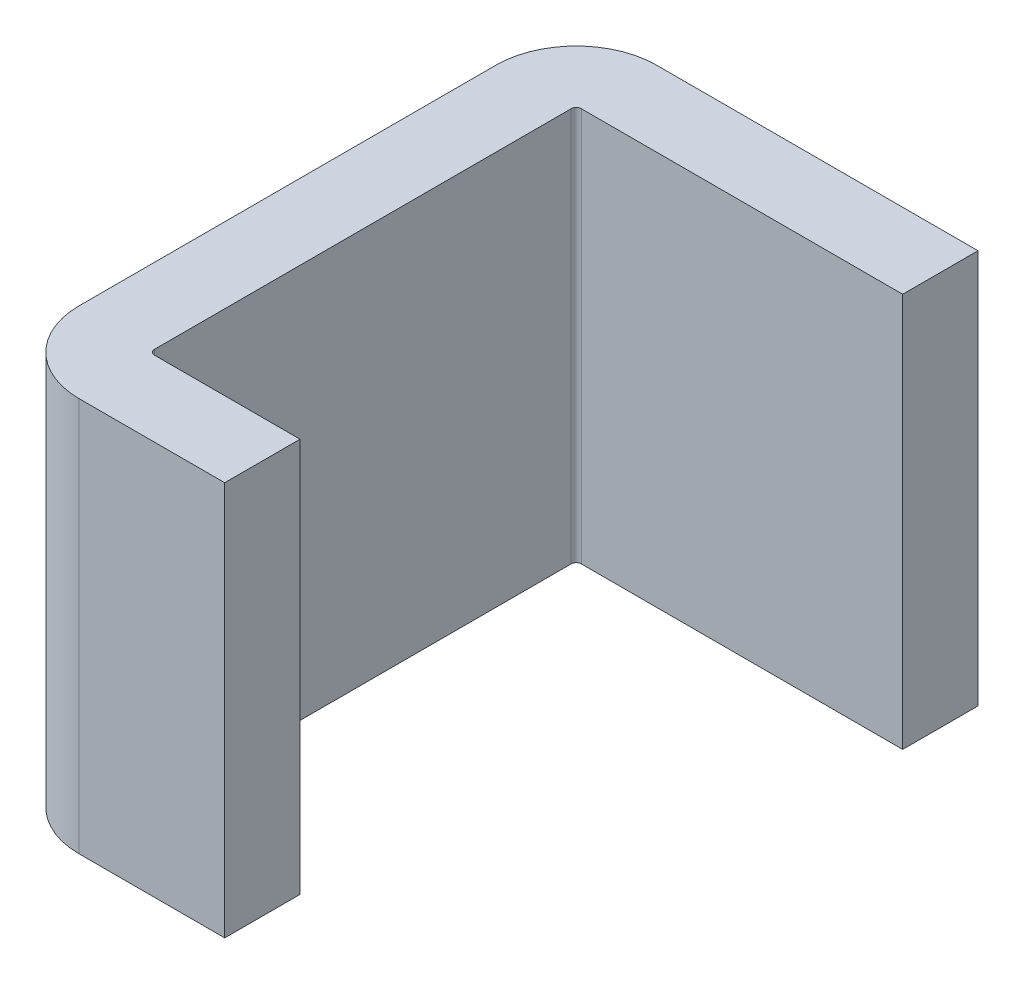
ISO-10303-21;
HEADER;
FILE_DESCRIPTION(('STEP AP214'),'2;1');
FILE_NAME('part.step','',(''),(''),'','','');
FILE_SCHEMA(('AUTOMOTIVE_DESIGN { 1 0 10303 214 1 1 1 1 }'));
ENDSEC;
DATA;
#1=APPLICATION_CONTEXT('core data for automotive mechanical design processes');
#2=APPLICATION_PROTOCOL_DEFINITION('international standard','automotive_design',2000,#1);
#3=PRODUCT_CONTEXT('',#1,'mechanical');
#4=PRODUCT('Part','Part','',(#3));
#5=PRODUCT_RELATED_PRODUCT_CATEGORY('part','',(#4));
#6=PRODUCT_DEFINITION_FORMATION('','',#4);
#7=PRODUCT_DEFINITION_CONTEXT('part definition',#1,'design');
#8=PRODUCT_DEFINITION('design','',#6,#7);
#9=PRODUCT_DEFINITION_SHAPE('','',#8);
#10=(LENGTH_UNIT() NAMED_UNIT(*) SI_UNIT(.MILLI.,.METRE.));
#11=(NAMED_UNIT(*) PLANE_ANGLE_UNIT() SI_UNIT($,.RADIAN.));
#12=(NAMED_UNIT(*) SI_UNIT($,.STERADIAN.) SOLID_ANGLE_UNIT());
#13=UNCERTAINTY_MEASURE_WITH_UNIT(LENGTH_MEASURE(1.E-05),#10,'distance_accuracy_value','');
#14=(GEOMETRIC_REPRESENTATION_CONTEXT(3) GLOBAL_UNCERTAINTY_ASSIGNED_CONTEXT((#13)) GLOBAL_UNIT_ASSIGNED_CONTEXT((#10,
#11,#12)) REPRESENTATION_CONTEXT('',''));
#15=CARTESIAN_POINT('',(0.,0.,0.));
#16=DIRECTION('',(0.,0.,1.));
#17=DIRECTION('',(1.,0.,0.));
#18=AXIS2_PLACEMENT_3D('',#15,#16,#17);
#19=CARTESIAN_POINT('',(-1.6,1.1,0.01));
#20=DIRECTION('',(1.,0.,0.));
#21=DIRECTION('',(0.,0.,1.));
#22=AXIS2_PLACEMENT_3D('',#19,#20,#21);
#23=PLANE('',#22);
#24=DIRECTION('',(0.,0.,1.));
#25=VECTOR('',#24,1.);
#26=CARTESIAN_POINT('',(-1.6,0.315,0.01));
#27=LINE('',#26,#25);
#28=CARTESIAN_POINT('',(-1.6,0.315,0.01));
#29=VERTEX_POINT('',#28);
#30=CARTESIAN_POINT('',(-1.6,0.315,0.84));
#31=VERTEX_POINT('',#30);
#32=EDGE_CURVE('E245',#29,#31,#27,.T.);
#33=ORIENTED_EDGE('',*,*,#32,.F.);
#34=DIRECTION('',(0.,-1.,0.));
#35=VECTOR('',#34,1.);
#36=CARTESIAN_POINT('',(-1.6,1.1,0.01));
#37=LINE('',#36,#35);
#38=CARTESIAN_POINT('',(-1.6,1.1,0.01));
#39=VERTEX_POINT('',#38);
#40=EDGE_CURVE('E192',#39,#29,#37,.T.);
#41=ORIENTED_EDGE('',*,*,#40,.F.);
#42=DIRECTION('',(0.,0.,1.));
#43=VECTOR('',#42,1.);
#44=CARTESIAN_POINT('',(-1.6,1.1,0.01));
#45=LINE('',#44,#43);
#46=CARTESIAN_POINT('',(-1.6,1.1,0.84));
#47=VERTEX_POINT('',#46);
#48=EDGE_CURVE('E201',#39,#47,#45,.T.);
#49=ORIENTED_EDGE('',*,*,#48,.T.);
#50=DIRECTION('',(0.,-1.,0.));
#51=VECTOR('',#50,1.);
#52=CARTESIAN_POINT('',(-1.6,1.1,0.84));
#53=LINE('',#52,#51);
#54=EDGE_CURVE('E11',#47,#31,#53,.T.);
#55=ORIENTED_EDGE('',*,*,#54,.T.);
#56=EDGE_LOOP('',(#33,#41,#49,#55));
#57=FACE_BOUND('',#56,.T.);
#58=ADVANCED_FACE('F17',(#57),#23,.T.);
#59=CARTESIAN_POINT('',(-1.59,0.,0.84));
#60=DIRECTION('',(0.,-1.,0.));
#61=DIRECTION('',(0.,0.,1.));
#62=AXIS2_PLACEMENT_3D('',#59,#60,#61);
#63=CYLINDRICAL_SURFACE('',#62,0.01);
#64=CARTESIAN_POINT('',(-1.59,0.315,0.84));
#65=DIRECTION('',(0.,1.,0.));
#66=DIRECTION('',(-1.,0.,0.));
#67=AXIS2_PLACEMENT_3D('',#64,#65,#66);
#68=CIRCLE('',#67,0.01);
#69=CARTESIAN_POINT('',(-1.59,0.315,0.85));
#70=VERTEX_POINT('',#69);
#71=EDGE_CURVE('E249',#31,#70,#68,.T.);
#72=ORIENTED_EDGE('',*,*,#71,.F.);
#73=ORIENTED_EDGE('',*,*,#54,.F.);
#74=CARTESIAN_POINT('',(-1.59,1.1,0.84));
#75=DIRECTION('',(0.,1.,0.));
#76=DIRECTION('',(-1.,0.,0.));
#77=AXIS2_PLACEMENT_3D('',#74,#75,#76);
#78=CIRCLE('',#77,0.01);
#79=CARTESIAN_POINT('',(-1.59,1.1,0.85));
#80=VERTEX_POINT('',#79);
#81=EDGE_CURVE('E187',#47,#80,#78,.T.);
#82=ORIENTED_EDGE('',*,*,#81,.T.);
#83=DIRECTION('',(0.,-1.,0.));
#84=VECTOR('',#83,1.);
#85=CARTESIAN_POINT('',(-1.59,1.1,0.85));
#86=LINE('',#85,#84);
#87=EDGE_CURVE('E220',#80,#70,#86,.T.);
#88=ORIENTED_EDGE('',*,*,#87,.T.);
#89=EDGE_LOOP('',(#72,#73,#82,#88));
#90=FACE_BOUND('',#89,.T.);
#91=ADVANCED_FACE('F383',(#90),#63,.F.);
#92=CARTESIAN_POINT('',(-1.3,0.,0.925));
#93=DIRECTION('',(-1.,0.,0.));
#94=DIRECTION('',(0.,0.,1.));
#95=AXIS2_PLACEMENT_3D('',#92,#93,#94);
#96=PLANE('',#95);
#97=DIRECTION('',(0.,1.,0.));
#98=VECTOR('',#97,1.);
#99=CARTESIAN_POINT('',(-1.3,-1.1,1.));
#100=LINE('',#99,#98);
#101=CARTESIAN_POINT('',(-1.3,0.315,1.));
#102=VERTEX_POINT('',#101);
#103=CARTESIAN_POINT('',(-1.3,1.1,1.));
#104=VERTEX_POINT('',#103);
#105=EDGE_CURVE('E37',#102,#104,#100,.T.);
#106=ORIENTED_EDGE('',*,*,#105,.F.);
#107=DIRECTION('',(0.,0.,-1.));
#108=VECTOR('',#107,1.);
#109=CARTESIAN_POINT('',(-1.3,0.315,0.925));
#110=LINE('',#109,#108);
#111=CARTESIAN_POINT('',(-1.3,0.315,0.85));
#112=VERTEX_POINT('',#111);
#113=EDGE_CURVE('E257',#102,#112,#110,.T.);
#114=ORIENTED_EDGE('',*,*,#113,.T.);
#115=DIRECTION('',(0.,-1.,0.));
#116=VECTOR('',#115,1.);
#117=CARTESIAN_POINT('',(-1.3,1.1,0.85));
#118=LINE('',#117,#116);
#119=CARTESIAN_POINT('',(-1.3,1.1,0.85));
#120=VERTEX_POINT('',#119);
#121=EDGE_CURVE('E25',#120,#112,#118,.T.);
#122=ORIENTED_EDGE('',*,*,#121,.F.);
#123=DIRECTION('',(0.,0.,-1.));
#124=VECTOR('',#123,1.);
#125=CARTESIAN_POINT('',(-1.3,1.1,1.));
#126=LINE('',#125,#124);
#127=EDGE_CURVE('E174',#104,#120,#126,.T.);
#128=ORIENTED_EDGE('',*,*,#127,.F.);
#129=EDGE_LOOP('',(#106,#114,#122,#128));
#130=FACE_BOUND('',#129,.T.);
#131=ADVANCED_FACE('F347',(#130),#96,.F.);
#132=CARTESIAN_POINT('',(-1.59,1.1,0.85));
#133=DIRECTION('',(0.,0.,-1.));
#134=DIRECTION('',(-1.,0.,0.));
#135=AXIS2_PLACEMENT_3D('',#132,#133,#134);
#136=PLANE('',#135);
#137=DIRECTION('',(1.,0.,0.));
#138=VECTOR('',#137,1.);
#139=CARTESIAN_POINT('',(-1.59,0.315,0.85));
#140=LINE('',#139,#138);
#141=EDGE_CURVE('E253',#70,#112,#140,.T.);
#142=ORIENTED_EDGE('',*,*,#141,.F.);
#143=ORIENTED_EDGE('',*,*,#87,.F.);
#144=DIRECTION('',(1.,0.,0.));
#145=VECTOR('',#144,1.);
#146=CARTESIAN_POINT('',(-1.59,1.1,0.85));
#147=LINE('',#146,#145);
#148=EDGE_CURVE('E184',#80,#120,#147,.T.);
#149=ORIENTED_EDGE('',*,*,#148,.T.);
#150=ORIENTED_EDGE('',*,*,#121,.T.);
#151=EDGE_LOOP('',(#142,#143,#149,#150));
#152=FACE_BOUND('',#151,.T.);
#153=ADVANCED_FACE('F342',(#152),#136,.T.);
#154=CARTESIAN_POINT('',(-1.59,-1.1,1.));
#155=DIRECTION('',(0.,0.,1.));
#156=DIRECTION('',(1.,0.,0.));
#157=AXIS2_PLACEMENT_3D('',#154,#155,#156);
#158=PLANE('',#157);
#159=DIRECTION('',(-1.,0.,0.));
#160=VECTOR('',#159,1.);
#161=CARTESIAN_POINT('',(-1.59,0.315,1.));
#162=LINE('',#161,#160);
#163=CARTESIAN_POINT('',(-1.59,0.315,1.));
#164=VERTEX_POINT('',#163);
#165=EDGE_CURVE('E228',#102,#164,#162,.T.);
#166=ORIENTED_EDGE('',*,*,#165,.F.);
#167=ORIENTED_EDGE('',*,*,#105,.T.);
#168=DIRECTION('',(1.,0.,0.));
#169=VECTOR('',#168,1.);
#170=CARTESIAN_POINT('',(-1.59,1.1,1.));
#171=LINE('',#170,#169);
#172=CARTESIAN_POINT('',(-1.59,1.1,1.));
#173=VERTEX_POINT('',#172);
#174=EDGE_CURVE('E191',#173,#104,#171,.T.);
#175=ORIENTED_EDGE('',*,*,#174,.F.);
#176=DIRECTION('',(0.,1.,0.));
#177=VECTOR('',#176,1.);
#178=CARTESIAN_POINT('',(-1.59,-1.1,1.));
#179=LINE('',#178,#177);
#180=EDGE_CURVE('E217',#164,#173,#179,.T.);
#181=ORIENTED_EDGE('',*,*,#180,.F.);
#182=EDGE_LOOP('',(#166,#167,#175,#181));
#183=FACE_BOUND('',#182,.T.);
#184=ADVANCED_FACE('F346',(#183),#158,.T.);
#185=CARTESIAN_POINT('',(-1.59,0.,0.01));
#186=DIRECTION('',(0.,-1.,0.));
#187=DIRECTION('',(0.,0.,1.));
#188=AXIS2_PLACEMENT_3D('',#185,#186,#187);
#189=CYLINDRICAL_SURFACE('',#188,0.01);
#190=CARTESIAN_POINT('',(-1.59,0.315,0.01));
#191=DIRECTION('',(0.,1.,0.));
#192=DIRECTION('',(-1.,0.,0.));
#193=AXIS2_PLACEMENT_3D('',#190,#191,#192);
#194=CIRCLE('',#193,0.01);
#195=CARTESIAN_POINT('',(-1.59,0.315,0.));
#196=VERTEX_POINT('',#195);
#197=EDGE_CURVE('E241',#196,#29,#194,.T.);
#198=ORIENTED_EDGE('',*,*,#197,.F.);
#199=DIRECTION('',(0.,-1.,0.));
#200=VECTOR('',#199,1.);
#201=CARTESIAN_POINT('',(-1.59,1.1,0.));
#202=LINE('',#201,#200);
#203=CARTESIAN_POINT('',(-1.59,1.1,0.));
#204=VERTEX_POINT('',#203);
#205=EDGE_CURVE('E195',#204,#196,#202,.T.);
#206=ORIENTED_EDGE('',*,*,#205,.F.);
#207=CARTESIAN_POINT('',(-1.59,1.1,0.01));
#208=DIRECTION('',(0.,1.,0.));
#209=DIRECTION('',(0.,0.,-1.));
#210=AXIS2_PLACEMENT_3D('',#207,#208,#209);
#211=CIRCLE('',#210,0.01);
#212=EDGE_CURVE('E179',#204,#39,#211,.T.);
#213=ORIENTED_EDGE('',*,*,#212,.T.);
#214=ORIENTED_EDGE('',*,*,#40,.T.);
#215=EDGE_LOOP('',(#198,#206,#213,#214));
#216=FACE_BOUND('',#215,.T.);
#217=ADVANCED_FACE('F356',(#216),#189,.F.);
#218=CARTESIAN_POINT('',(-0.95,0.,-0.075));
#219=DIRECTION('',(1.,0.,0.));
#220=DIRECTION('',(0.,1.,0.));
#221=AXIS2_PLACEMENT_3D('',#218,#219,#220);
#222=PLANE('',#221);
#223=DIRECTION('',(0.,0.,1.));
#224=VECTOR('',#223,1.);
#225=CARTESIAN_POINT('',(-0.95,0.315,-1.608456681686));
#226=LINE('',#225,#224);
#227=CARTESIAN_POINT('',(-0.95,0.315,-0.15));
#228=VERTEX_POINT('',#227);
#229=CARTESIAN_POINT('',(-0.95,0.315,0.));
#230=VERTEX_POINT('',#229);
#231=EDGE_CURVE('E141',#228,#230,#226,.T.);
#232=ORIENTED_EDGE('',*,*,#231,.F.);
#233=DIRECTION('',(0.,1.,0.));
#234=VECTOR('',#233,1.);
#235=CARTESIAN_POINT('',(-0.95,-1.1,-0.15));
#236=LINE('',#235,#234);
#237=CARTESIAN_POINT('',(-0.95,1.1,-0.15));
#238=VERTEX_POINT('',#237);
#239=EDGE_CURVE('E135',#228,#238,#236,.T.);
#240=ORIENTED_EDGE('',*,*,#239,.T.);
#241=DIRECTION('',(0.,0.,1.));
#242=VECTOR('',#241,1.);
#243=CARTESIAN_POINT('',(-0.95,1.1,-0.15));
#244=LINE('',#243,#242);
#245=CARTESIAN_POINT('',(-0.95,1.1,0.));
#246=VERTEX_POINT('',#245);
#247=EDGE_CURVE('E138',#238,#246,#244,.T.);
#248=ORIENTED_EDGE('',*,*,#247,.T.);
#249=DIRECTION('',(0.,-1.,0.));
#250=VECTOR('',#249,1.);
#251=CARTESIAN_POINT('',(-0.95,1.1,0.));
#252=LINE('',#251,#250);
#253=EDGE_CURVE('E225',#246,#230,#252,.T.);
#254=ORIENTED_EDGE('',*,*,#253,.T.);
#255=EDGE_LOOP('',(#232,#240,#248,#254));
#256=FACE_BOUND('',#255,.T.);
#257=ADVANCED_FACE('F137',(#256),#222,.T.);
#258=CARTESIAN_POINT('',(-0.95,1.1,0.));
#259=DIRECTION('',(0.,0.,1.));
#260=DIRECTION('',(0.,-1.,0.));
#261=AXIS2_PLACEMENT_3D('',#258,#259,#260);
#262=PLANE('',#261);
#263=DIRECTION('',(-1.,0.,0.));
#264=VECTOR('',#263,1.);
#265=CARTESIAN_POINT('',(-0.95,0.315,0.));
#266=LINE('',#265,#264);
#267=EDGE_CURVE('E175',#230,#196,#266,.T.);
#268=ORIENTED_EDGE('',*,*,#267,.F.);
#269=ORIENTED_EDGE('',*,*,#253,.F.);
#270=DIRECTION('',(-1.,0.,0.));
#271=VECTOR('',#270,1.);
#272=CARTESIAN_POINT('',(-0.95,1.1,0.));
#273=LINE('',#272,#271);
#274=EDGE_CURVE('E155',#246,#204,#273,.T.);
#275=ORIENTED_EDGE('',*,*,#274,.T.);
#276=ORIENTED_EDGE('',*,*,#205,.T.);
#277=EDGE_LOOP('',(#268,#269,#275,#276));
#278=FACE_BOUND('',#277,.T.);
#279=ADVANCED_FACE('F272',(#278),#262,.T.);
#280=CARTESIAN_POINT('',(-0.95,0.315,-1.608456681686));
#281=DIRECTION('',(0.,1.,0.));
#282=DIRECTION('',(1.,0.,0.));
#283=AXIS2_PLACEMENT_3D('',#280,#281,#282);
#284=PLANE('',#283);
#285=DIRECTION('',(1.,0.,0.));
#286=VECTOR('',#285,1.);
#287=CARTESIAN_POINT('',(-0.95,0.315,-0.15));
#288=LINE('',#287,#286);
#289=CARTESIAN_POINT('',(-1.59,0.315,-0.15));
#290=VERTEX_POINT('',#289);
#291=EDGE_CURVE('E146',#290,#228,#288,.T.);
#292=ORIENTED_EDGE('',*,*,#291,.T.);
#293=ORIENTED_EDGE('',*,*,#231,.T.);
#294=ORIENTED_EDGE('',*,*,#267,.T.);
#295=ORIENTED_EDGE('',*,*,#197,.T.);
#296=ORIENTED_EDGE('',*,*,#32,.T.);
#297=ORIENTED_EDGE('',*,*,#71,.T.);
#298=ORIENTED_EDGE('',*,*,#141,.T.);
#299=ORIENTED_EDGE('',*,*,#113,.F.);
#300=ORIENTED_EDGE('',*,*,#165,.T.);
#301=CARTESIAN_POINT('',(-1.59,0.315,0.84));
#302=DIRECTION('',(0.,1.,0.));
#303=DIRECTION('',(-1.,0.,0.));
#304=AXIS2_PLACEMENT_3D('',#301,#302,#303);
#305=CIRCLE('',#304,0.16);
#306=CARTESIAN_POINT('',(-1.75,0.315,0.84));
#307=VERTEX_POINT('',#306);
#308=EDGE_CURVE('E157',#307,#164,#305,.T.);
#309=ORIENTED_EDGE('',*,*,#308,.F.);
#310=DIRECTION('',(0.,0.,1.));
#311=VECTOR('',#310,1.);
#312=CARTESIAN_POINT('',(-1.75,0.315,-1.608456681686));
#313=LINE('',#312,#311);
#314=CARTESIAN_POINT('',(-1.75,0.315,0.01));
#315=VERTEX_POINT('',#314);
#316=EDGE_CURVE('E203',#315,#307,#313,.T.);
#317=ORIENTED_EDGE('',*,*,#316,.F.);
#318=CARTESIAN_POINT('',(-1.59,0.315,0.01));
#319=DIRECTION('',(0.,1.,0.));
#320=DIRECTION('',(-1.,0.,0.));
#321=AXIS2_PLACEMENT_3D('',#318,#319,#320);
#322=CIRCLE('',#321,0.16);
#323=EDGE_CURVE('E231',#290,#315,#322,.T.);
#324=ORIENTED_EDGE('',*,*,#323,.F.);
#325=EDGE_LOOP('',(#292,#293,#294,#295,#296,#297,#298,#299,#300,#309,#317,#324));
#326=FACE_BOUND('',#325,.T.);
#327=ADVANCED_FACE('F278',(#326),#284,.F.);
#328=CARTESIAN_POINT('',(-0.95,-1.1,-0.15));
#329=DIRECTION('',(0.,0.,-1.));
#330=DIRECTION('',(0.,-1.,0.));
#331=AXIS2_PLACEMENT_3D('',#328,#329,#330);
#332=PLANE('',#331);
#333=ORIENTED_EDGE('',*,*,#291,.F.);
#334=DIRECTION('',(0.,1.,0.));
#335=VECTOR('',#334,1.);
#336=CARTESIAN_POINT('',(-1.59,-1.1,-0.15));
#337=LINE('',#336,#335);
#338=CARTESIAN_POINT('',(-1.59,1.1,-0.15));
#339=VERTEX_POINT('',#338);
#340=EDGE_CURVE('E161',#290,#339,#337,.T.);
#341=ORIENTED_EDGE('',*,*,#340,.T.);
#342=DIRECTION('',(-1.,0.,0.));
#343=VECTOR('',#342,1.);
#344=CARTESIAN_POINT('',(-0.95,1.1,-0.15));
#345=LINE('',#344,#343);
#346=EDGE_CURVE('E152',#238,#339,#345,.T.);
#347=ORIENTED_EDGE('',*,*,#346,.F.);
#348=ORIENTED_EDGE('',*,*,#239,.F.);
#349=EDGE_LOOP('',(#333,#341,#347,#348));
#350=FACE_BOUND('',#349,.T.);
#351=ADVANCED_FACE('F159',(#350),#332,.T.);
#352=CARTESIAN_POINT('',(-1.59,0.,0.01));
#353=DIRECTION('',(0.,-1.,0.));
#354=DIRECTION('',(0.,0.,1.));
#355=AXIS2_PLACEMENT_3D('',#352,#353,#354);
#356=CYLINDRICAL_SURFACE('',#355,0.16);
#357=ORIENTED_EDGE('',*,*,#323,.T.);
#358=DIRECTION('',(0.,1.,0.));
#359=VECTOR('',#358,1.);
#360=CARTESIAN_POINT('',(-1.75,-1.1,0.01));
#361=LINE('',#360,#359);
#362=CARTESIAN_POINT('',(-1.75,1.1,0.01));
#363=VERTEX_POINT('',#362);
#364=EDGE_CURVE('E206',#315,#363,#361,.T.);
#365=ORIENTED_EDGE('',*,*,#364,.T.);
#366=CARTESIAN_POINT('',(-1.59,1.1,0.01));
#367=DIRECTION('',(0.,1.,0.));
#368=DIRECTION('',(0.,0.,-1.));
#369=AXIS2_PLACEMENT_3D('',#366,#367,#368);
#370=CIRCLE('',#369,0.16);
#371=EDGE_CURVE('E164',#339,#363,#370,.T.);
#372=ORIENTED_EDGE('',*,*,#371,.F.);
#373=ORIENTED_EDGE('',*,*,#340,.F.);
#374=EDGE_LOOP('',(#357,#365,#372,#373));
#375=FACE_BOUND('',#374,.T.);
#376=ADVANCED_FACE('F290',(#375),#356,.T.);
#377=CARTESIAN_POINT('',(-1.75,-1.1,0.01));
#378=DIRECTION('',(-1.,0.,0.));
#379=DIRECTION('',(0.,0.,1.));
#380=AXIS2_PLACEMENT_3D('',#377,#378,#379);
#381=PLANE('',#380);
#382=ORIENTED_EDGE('',*,*,#316,.T.);
#383=DIRECTION('',(0.,1.,0.));
#384=VECTOR('',#383,1.);
#385=CARTESIAN_POINT('',(-1.75,-1.1,0.84));
#386=LINE('',#385,#384);
#387=CARTESIAN_POINT('',(-1.75,1.1,0.84));
#388=VERTEX_POINT('',#387);
#389=EDGE_CURVE('E207',#307,#388,#386,.T.);
#390=ORIENTED_EDGE('',*,*,#389,.T.);
#391=DIRECTION('',(0.,0.,1.));
#392=VECTOR('',#391,1.);
#393=CARTESIAN_POINT('',(-1.75,1.1,0.01));
#394=LINE('',#393,#392);
#395=EDGE_CURVE('E170',#363,#388,#394,.T.);
#396=ORIENTED_EDGE('',*,*,#395,.F.);
#397=ORIENTED_EDGE('',*,*,#364,.F.);
#398=EDGE_LOOP('',(#382,#390,#396,#397));
#399=FACE_BOUND('',#398,.T.);
#400=ADVANCED_FACE('F308',(#399),#381,.T.);
#401=CARTESIAN_POINT('',(-1.59,0.,0.84));
#402=DIRECTION('',(0.,-1.,0.));
#403=DIRECTION('',(0.,0.,1.));
#404=AXIS2_PLACEMENT_3D('',#401,#402,#403);
#405=CYLINDRICAL_SURFACE('',#404,0.16);
#406=ORIENTED_EDGE('',*,*,#308,.T.);
#407=ORIENTED_EDGE('',*,*,#180,.T.);
#408=CARTESIAN_POINT('',(-1.59,1.1,0.84));
#409=DIRECTION('',(0.,1.,0.));
#410=DIRECTION('',(-1.,0.,0.));
#411=AXIS2_PLACEMENT_3D('',#408,#409,#410);
#412=CIRCLE('',#411,0.16);
#413=EDGE_CURVE('E183',#388,#173,#412,.T.);
#414=ORIENTED_EDGE('',*,*,#413,.F.);
#415=ORIENTED_EDGE('',*,*,#389,.F.);
#416=EDGE_LOOP('',(#406,#407,#414,#415));
#417=FACE_BOUND('',#416,.T.);
#418=ADVANCED_FACE('F299',(#417),#405,.T.);
#419=CARTESIAN_POINT('',(-0.95,1.1,-0.15));
#420=DIRECTION('',(0.,1.,0.));
#421=DIRECTION('',(1.,0.,0.));
#422=AXIS2_PLACEMENT_3D('',#419,#420,#421);
#423=PLANE('',#422);
#424=ORIENTED_EDGE('',*,*,#346,.T.);
#425=ORIENTED_EDGE('',*,*,#371,.T.);
#426=ORIENTED_EDGE('',*,*,#395,.T.);
#427=ORIENTED_EDGE('',*,*,#413,.T.);
#428=ORIENTED_EDGE('',*,*,#174,.T.);
#429=ORIENTED_EDGE('',*,*,#127,.T.);
#430=ORIENTED_EDGE('',*,*,#148,.F.);
#431=ORIENTED_EDGE('',*,*,#81,.F.);
#432=ORIENTED_EDGE('',*,*,#48,.F.);
#433=ORIENTED_EDGE('',*,*,#212,.F.);
#434=ORIENTED_EDGE('',*,*,#274,.F.);
#435=ORIENTED_EDGE('',*,*,#247,.F.);
#436=EDGE_LOOP('',(#424,#425,#426,#427,#428,#429,#430,#431,#432,#433,#434,#435));
#437=FACE_BOUND('',#436,.T.);
#438=ADVANCED_FACE('F150',(#437),#423,.T.);
#439=CLOSED_SHELL('',(#58,#91,#131,#153,#184,#217,#257,#279,#327,#351,#376,#400,#418,#438));
#440=MANIFOLD_SOLID_BREP('B1',#439);
#441=ADVANCED_BREP_SHAPE_REPRESENTATION('',(#18,#440),#14);
#442=SHAPE_DEFINITION_REPRESENTATION(#9,#441);
ENDSEC;
END-ISO-10303-21;
